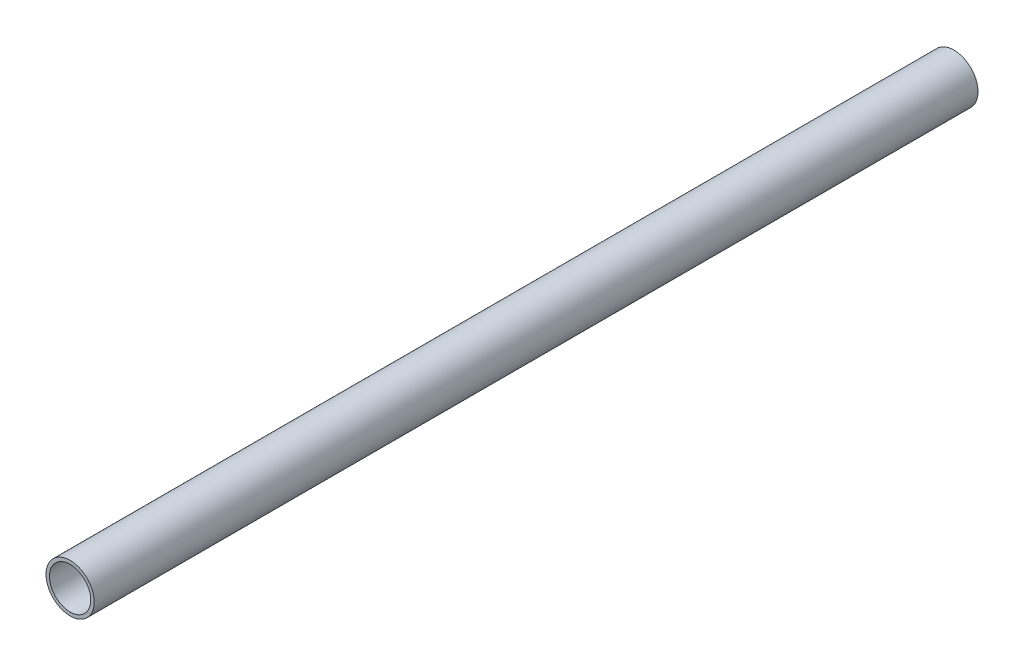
ISO-10303-21;
HEADER;
FILE_DESCRIPTION(('STEP AP214'),'2;1');
FILE_NAME('part.step','',(''),(''),'','','');
FILE_SCHEMA(('AUTOMOTIVE_DESIGN { 1 0 10303 214 1 1 1 1 }'));
ENDSEC;
DATA;
#1=APPLICATION_CONTEXT('core data for automotive mechanical design processes');
#2=APPLICATION_PROTOCOL_DEFINITION('international standard','automotive_design',2000,#1);
#3=PRODUCT_CONTEXT('',#1,'mechanical');
#4=PRODUCT('Part','Part','',(#3));
#5=PRODUCT_RELATED_PRODUCT_CATEGORY('part','',(#4));
#6=PRODUCT_DEFINITION_FORMATION('','',#4);
#7=PRODUCT_DEFINITION_CONTEXT('part definition',#1,'design');
#8=PRODUCT_DEFINITION('design','',#6,#7);
#9=PRODUCT_DEFINITION_SHAPE('','',#8);
#10=(LENGTH_UNIT() NAMED_UNIT(*) SI_UNIT(.MILLI.,.METRE.));
#11=(NAMED_UNIT(*) PLANE_ANGLE_UNIT() SI_UNIT($,.RADIAN.));
#12=(NAMED_UNIT(*) SI_UNIT($,.STERADIAN.) SOLID_ANGLE_UNIT());
#13=UNCERTAINTY_MEASURE_WITH_UNIT(LENGTH_MEASURE(1.E-05),#10,'distance_accuracy_value','');
#14=(GEOMETRIC_REPRESENTATION_CONTEXT(3) GLOBAL_UNCERTAINTY_ASSIGNED_CONTEXT((#13)) GLOBAL_UNIT_ASSIGNED_CONTEXT((#10,
#11,#12)) REPRESENTATION_CONTEXT('',''));
#15=CARTESIAN_POINT('',(0.,0.,0.));
#16=DIRECTION('',(0.,0.,1.));
#17=DIRECTION('',(1.,0.,0.));
#18=AXIS2_PLACEMENT_3D('',#15,#16,#17);
#19=CARTESIAN_POINT('',(0.,0.,-5796.801));
#20=DIRECTION('',(0.,0.,-1.));
#21=DIRECTION('',(-1.,0.,0.));
#22=AXIS2_PLACEMENT_3D('',#19,#20,#21);
#23=CYLINDRICAL_SURFACE('',#22,15.);
#24=CARTESIAN_POINT('',(0.,0.,426.744312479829));
#25=DIRECTION('',(0.,0.,-1.));
#26=DIRECTION('',(-1.,0.,0.));
#27=AXIS2_PLACEMENT_3D('',#24,#25,#26);
#28=CIRCLE('',#27,15.);
#29=CARTESIAN_POINT('',(-15.,0.,426.744312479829));
#30=VERTEX_POINT('',#29);
#31=EDGE_CURVE('E10',#30,#30,#28,.T.);
#32=ORIENTED_EDGE('',*,*,#31,.F.);
#33=EDGE_LOOP('',(#32));
#34=FACE_BOUND('',#33,.T.);
#35=CARTESIAN_POINT('',(0.,0.,-214.9546875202));
#36=DIRECTION('',(0.,0.,-1.));
#37=DIRECTION('',(-1.,0.,0.));
#38=AXIS2_PLACEMENT_3D('',#35,#36,#37);
#39=CIRCLE('',#38,15.);
#40=CARTESIAN_POINT('',(-15.,0.,-214.9546875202));
#41=VERTEX_POINT('',#40);
#42=EDGE_CURVE('E49',#41,#41,#39,.T.);
#43=ORIENTED_EDGE('',*,*,#42,.T.);
#44=EDGE_LOOP('',(#43));
#45=FACE_BOUND('',#44,.T.);
#46=ADVANCED_FACE('F34',(#34,#45),#23,.F.);
#47=CARTESIAN_POINT('',(0.,0.,-5796.801));
#48=DIRECTION('',(0.,0.,-1.));
#49=DIRECTION('',(-1.,0.,0.));
#50=AXIS2_PLACEMENT_3D('',#47,#48,#49);
#51=CYLINDRICAL_SURFACE('',#50,17.5);
#52=CARTESIAN_POINT('',(0.,0.,426.744312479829));
#53=DIRECTION('',(0.,0.,-1.));
#54=DIRECTION('',(-1.,0.,0.));
#55=AXIS2_PLACEMENT_3D('',#52,#53,#54);
#56=CIRCLE('',#55,17.5);
#57=CARTESIAN_POINT('',(-17.5,0.,426.744312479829));
#58=VERTEX_POINT('',#57);
#59=EDGE_CURVE('E38',#58,#58,#56,.T.);
#60=ORIENTED_EDGE('',*,*,#59,.T.);
#61=EDGE_LOOP('',(#60));
#62=FACE_BOUND('',#61,.T.);
#63=CARTESIAN_POINT('',(0.,0.,-214.9546875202));
#64=DIRECTION('',(0.,0.,-1.));
#65=DIRECTION('',(-1.,0.,0.));
#66=AXIS2_PLACEMENT_3D('',#63,#64,#65);
#67=CIRCLE('',#66,17.5);
#68=CARTESIAN_POINT('',(-17.5,0.,-214.9546875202));
#69=VERTEX_POINT('',#68);
#70=EDGE_CURVE('E45',#69,#69,#67,.F.);
#71=ORIENTED_EDGE('',*,*,#70,.T.);
#72=EDGE_LOOP('',(#71));
#73=FACE_BOUND('',#72,.T.);
#74=ADVANCED_FACE('F36',(#62,#73),#51,.T.);
#75=CARTESIAN_POINT('',(11.01259271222,21.,426.744312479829));
#76=DIRECTION('',(0.,0.,1.));
#77=DIRECTION('',(1.,0.,0.));
#78=AXIS2_PLACEMENT_3D('',#75,#76,#77);
#79=PLANE('',#78);
#80=ORIENTED_EDGE('',*,*,#31,.T.);
#81=EDGE_LOOP('',(#80));
#82=FACE_BOUND('',#81,.T.);
#83=ORIENTED_EDGE('',*,*,#59,.F.);
#84=EDGE_LOOP('',(#83));
#85=FACE_BOUND('',#84,.T.);
#86=ADVANCED_FACE('F57',(#82,#85),#79,.T.);
#87=CARTESIAN_POINT('',(11.01259271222,21.,-214.9546875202));
#88=DIRECTION('',(0.,0.,1.));
#89=DIRECTION('',(1.,0.,0.));
#90=AXIS2_PLACEMENT_3D('',#87,#88,#89);
#91=PLANE('',#90);
#92=ORIENTED_EDGE('',*,*,#42,.F.);
#93=EDGE_LOOP('',(#92));
#94=FACE_BOUND('',#93,.T.);
#95=ORIENTED_EDGE('',*,*,#70,.F.);
#96=EDGE_LOOP('',(#95));
#97=FACE_BOUND('',#96,.T.);
#98=ADVANCED_FACE('F54',(#94,#97),#91,.F.);
#99=CLOSED_SHELL('',(#46,#74,#86,#98));
#100=MANIFOLD_SOLID_BREP('B2',#99);
#101=ADVANCED_BREP_SHAPE_REPRESENTATION('',(#18,#100),#14);
#102=SHAPE_DEFINITION_REPRESENTATION(#9,#101);
ENDSEC;
END-ISO-10303-21;
